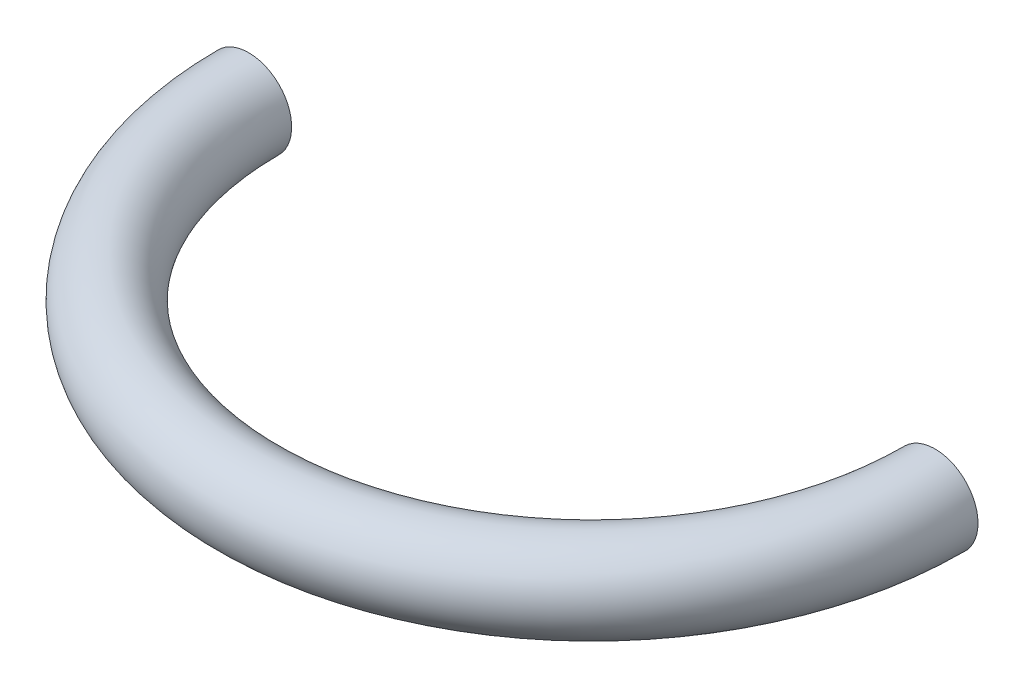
ISO-10303-21;
HEADER;
FILE_DESCRIPTION(('STEP AP214'),'2;1');
FILE_NAME('part.step','',(''),(''),'','','');
FILE_SCHEMA(('AUTOMOTIVE_DESIGN { 1 0 10303 214 1 1 1 1 }'));
ENDSEC;
DATA;
#1=APPLICATION_CONTEXT('core data for automotive mechanical design processes');
#2=APPLICATION_PROTOCOL_DEFINITION('international standard','automotive_design',2000,#1);
#3=PRODUCT_CONTEXT('',#1,'mechanical');
#4=PRODUCT('Part','Part','',(#3));
#5=PRODUCT_RELATED_PRODUCT_CATEGORY('part','',(#4));
#6=PRODUCT_DEFINITION_FORMATION('','',#4);
#7=PRODUCT_DEFINITION_CONTEXT('part definition',#1,'design');
#8=PRODUCT_DEFINITION('design','',#6,#7);
#9=PRODUCT_DEFINITION_SHAPE('','',#8);
#10=(LENGTH_UNIT() NAMED_UNIT(*) SI_UNIT(.MILLI.,.METRE.));
#11=(NAMED_UNIT(*) PLANE_ANGLE_UNIT() SI_UNIT($,.RADIAN.));
#12=(NAMED_UNIT(*) SI_UNIT($,.STERADIAN.) SOLID_ANGLE_UNIT());
#13=UNCERTAINTY_MEASURE_WITH_UNIT(LENGTH_MEASURE(1.E-05),#10,'distance_accuracy_value','');
#14=(GEOMETRIC_REPRESENTATION_CONTEXT(3) GLOBAL_UNCERTAINTY_ASSIGNED_CONTEXT((#13)) GLOBAL_UNIT_ASSIGNED_CONTEXT((#10,
#11,#12)) REPRESENTATION_CONTEXT('',''));
#15=CARTESIAN_POINT('',(0.,0.,0.));
#16=DIRECTION('',(0.,0.,1.));
#17=DIRECTION('',(1.,0.,0.));
#18=AXIS2_PLACEMENT_3D('',#15,#16,#17);
#19=CARTESIAN_POINT('',(0.,0.,0.));
#20=DIRECTION('',(0.,-1.,0.));
#21=DIRECTION('',(0.,0.,-1.));
#22=AXIS2_PLACEMENT_3D('',#19,#20,#21);
#23=TOROIDAL_SURFACE('',#22,20.,2.5);
#24=CARTESIAN_POINT('',(20.,0.,-1.39659253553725E-13));
#25=DIRECTION('',(0.,0.,-1.));
#26=DIRECTION('',(-1.,0.,0.));
#27=AXIS2_PLACEMENT_3D('',#24,#25,#26);
#28=CIRCLE('',#27,2.5);
#29=CARTESIAN_POINT('',(22.5,0.,-1.57116660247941E-13));
#30=VERTEX_POINT('',#29);
#31=EDGE_CURVE('E10',#30,#30,#28,.T.);
#32=CARTESIAN_POINT('',(-20.,0.,0.));
#33=DIRECTION('',(0.,0.,1.));
#34=DIRECTION('',(1.,0.,0.));
#35=AXIS2_PLACEMENT_3D('',#32,#33,#34);
#36=CIRCLE('',#35,2.5);
#37=CARTESIAN_POINT('',(-22.5,0.,0.));
#38=VERTEX_POINT('',#37);
#39=EDGE_CURVE('E38',#38,#38,#36,.T.);
#40=CARTESIAN_POINT('',(0.,0.,0.));
#41=DIRECTION('',(0.,-1.,0.));
#42=DIRECTION('',(0.,0.,-1.));
#43=AXIS2_PLACEMENT_3D('',#40,#41,#42);
#44=CIRCLE('',#43,22.5);
#45=EDGE_CURVE('',#30,#38,#44,.T.);
#46=ORIENTED_EDGE('',*,*,#31,.F.);
#47=ORIENTED_EDGE('',*,*,#39,.T.);
#48=ORIENTED_EDGE('',*,*,#45,.T.);
#49=ORIENTED_EDGE('',*,*,#45,.F.);
#50=EDGE_LOOP('',(#46,#48,#47,#49));
#51=FACE_BOUND('',#50,.T.);
#52=ADVANCED_FACE('F32',(#51),#23,.T.);
#53=CARTESIAN_POINT('',(20.,0.,-1.39659253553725E-13));
#54=DIRECTION('',(0.,0.,-1.));
#55=DIRECTION('',(-1.,0.,0.));
#56=AXIS2_PLACEMENT_3D('',#53,#54,#55);
#57=PLANE('',#56);
#58=ORIENTED_EDGE('',*,*,#31,.T.);
#59=EDGE_LOOP('',(#58));
#60=FACE_BOUND('',#59,.T.);
#61=ADVANCED_FACE('F47',(#60),#57,.T.);
#62=CARTESIAN_POINT('',(-20.,0.,0.));
#63=DIRECTION('',(0.,0.,1.));
#64=DIRECTION('',(1.,0.,0.));
#65=AXIS2_PLACEMENT_3D('',#62,#63,#64);
#66=PLANE('',#65);
#67=ORIENTED_EDGE('',*,*,#39,.F.);
#68=EDGE_LOOP('',(#67));
#69=FACE_BOUND('',#68,.T.);
#70=ADVANCED_FACE('F45',(#69),#66,.F.);
#71=CLOSED_SHELL('',(#52,#61,#70));
#72=MANIFOLD_SOLID_BREP('B2',#71);
#73=ADVANCED_BREP_SHAPE_REPRESENTATION('',(#18,#72),#14);
#74=SHAPE_DEFINITION_REPRESENTATION(#9,#73);
ENDSEC;
END-ISO-10303-21;
